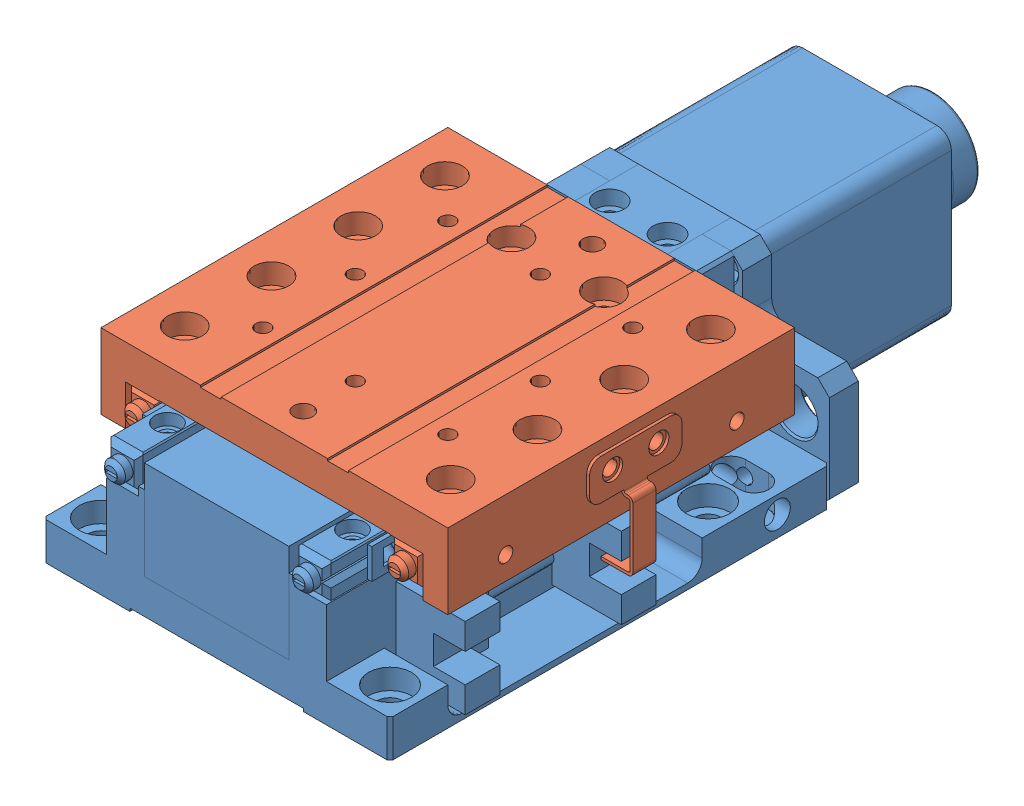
SolidWorks assembly TCD-06020.SLDASM, configuration 默认 (file format 9000). Lengths in mm.
Overall size (64 30 126).
2 component instances, 2 part files, 3 mates.
Components (placement in the parent):
- TCD-06020-01-1: TCD-06020-01.SLDPRT [默认] at (87.9908 82.3215 76.6858) size (62 30 126)
- TCD-06020-02-1: TCD-06020-02.SLDPRT [默认] at (87.9908 82.3215 76.6858) size (64 22.5 64)
Mates (geometry in assembly coordinates):
- 同心1: concentric anti-aligned: cylinder of TCD-06020-01-1 through (56.5756 116.8503 93.5182) axis (0 0 1) radius 3; cylinder of TCD-06020-02-1 through (56.5756 116.8503 124.5182) axis (0 0 -1) radius 3
- LimitDistance1: limit distance anti-aligned: plane of TCD-06020-02-1 through (35.7291 121.7039 101.5182) normal (0 0 -1); plane of TCD-06020-01-1 through (56.5756 116.3503 101.5182) normal (0 0 1)
- 重合2: coincident aligned: plane of TCD-06020-01-1 through (56.5756 131.3503 101.5182) normal (0 1 0); plane of TCD-06020-02-1 through (86.5756 131.3503 101.5182) normal (0 1 0)
